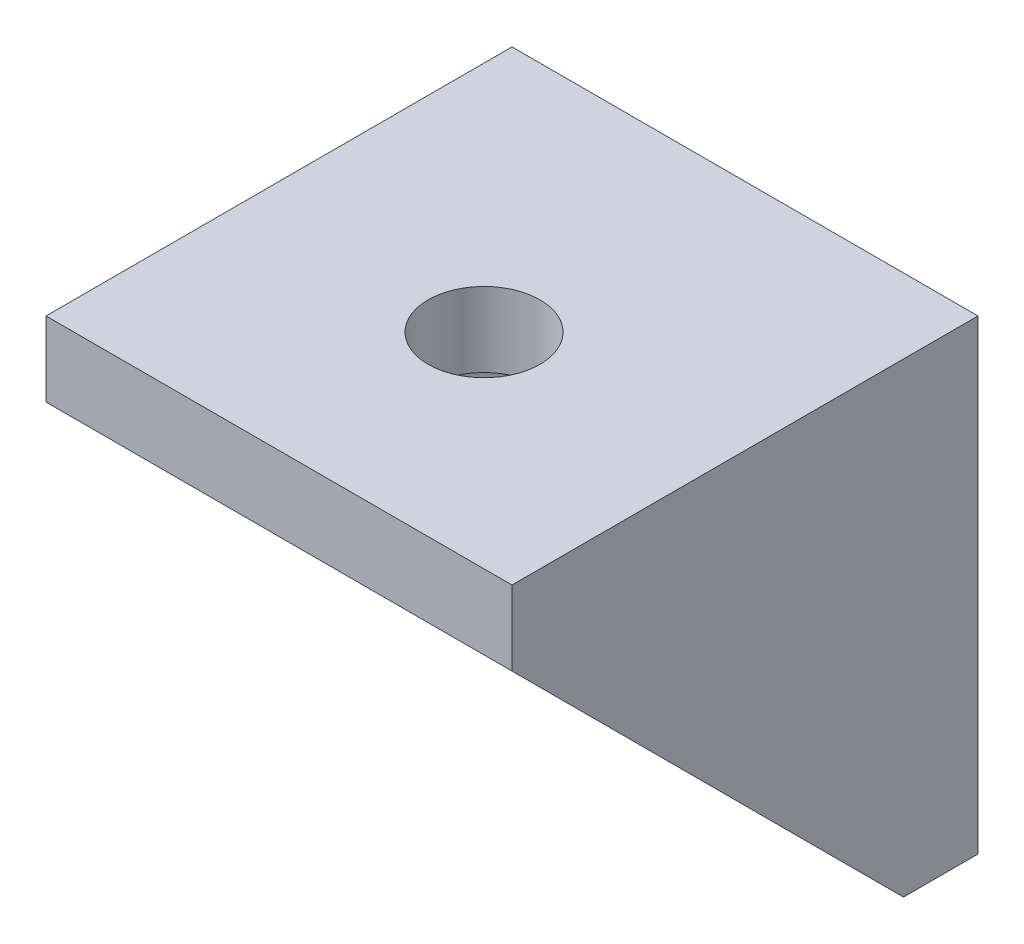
ISO-10303-21;
HEADER;
FILE_DESCRIPTION(('STEP AP214'),'2;1');
FILE_NAME('part.step','',(''),(''),'','','');
FILE_SCHEMA(('AUTOMOTIVE_DESIGN { 1 0 10303 214 1 1 1 1 }'));
ENDSEC;
DATA;
#1=APPLICATION_CONTEXT('core data for automotive mechanical design processes');
#2=APPLICATION_PROTOCOL_DEFINITION('international standard','automotive_design',2000,#1);
#3=PRODUCT_CONTEXT('',#1,'mechanical');
#4=PRODUCT('Part','Part','',(#3));
#5=PRODUCT_RELATED_PRODUCT_CATEGORY('part','',(#4));
#6=PRODUCT_DEFINITION_FORMATION('','',#4);
#7=PRODUCT_DEFINITION_CONTEXT('part definition',#1,'design');
#8=PRODUCT_DEFINITION('design','',#6,#7);
#9=PRODUCT_DEFINITION_SHAPE('','',#8);
#10=(LENGTH_UNIT() NAMED_UNIT(*) SI_UNIT(.MILLI.,.METRE.));
#11=(NAMED_UNIT(*) PLANE_ANGLE_UNIT() SI_UNIT($,.RADIAN.));
#12=(NAMED_UNIT(*) SI_UNIT($,.STERADIAN.) SOLID_ANGLE_UNIT());
#13=UNCERTAINTY_MEASURE_WITH_UNIT(LENGTH_MEASURE(1.E-05),#10,'distance_accuracy_value','');
#14=(GEOMETRIC_REPRESENTATION_CONTEXT(3) GLOBAL_UNCERTAINTY_ASSIGNED_CONTEXT((#13)) GLOBAL_UNIT_ASSIGNED_CONTEXT((#10,
#11,#12)) REPRESENTATION_CONTEXT('',''));
#15=CARTESIAN_POINT('',(0.,0.,0.));
#16=DIRECTION('',(0.,0.,1.));
#17=DIRECTION('',(1.,0.,0.));
#18=AXIS2_PLACEMENT_3D('',#15,#16,#17);
#19=CARTESIAN_POINT('',(0.,0.,4.));
#20=DIRECTION('',(0.,0.,-1.));
#21=DIRECTION('',(-1.,0.,0.));
#22=AXIS2_PLACEMENT_3D('',#19,#20,#21);
#23=PLANE('',#22);
#24=CARTESIAN_POINT('',(0.,0.,4.));
#25=DIRECTION('',(0.,0.,1.));
#26=DIRECTION('',(1.,0.,0.));
#27=AXIS2_PLACEMENT_3D('',#24,#25,#26);
#28=CIRCLE('',#27,3.);
#29=CARTESIAN_POINT('',(3.,0.,4.));
#30=VERTEX_POINT('',#29);
#31=EDGE_CURVE('E133',#30,#30,#28,.T.);
#32=ORIENTED_EDGE('',*,*,#31,.F.);
#33=EDGE_LOOP('',(#32));
#34=FACE_BOUND('',#33,.T.);
#35=DIRECTION('',(0.,1.,0.));
#36=VECTOR('',#35,1.);
#37=CARTESIAN_POINT('',(-8.5,-12.5,4.));
#38=LINE('',#37,#36);
#39=CARTESIAN_POINT('',(-8.5,-12.5,4.));
#40=VERTEX_POINT('',#39);
#41=CARTESIAN_POINT('',(-8.5,8.5,4.));
#42=VERTEX_POINT('',#41);
#43=EDGE_CURVE('E100',#40,#42,#38,.T.);
#44=ORIENTED_EDGE('',*,*,#43,.F.);
#45=DIRECTION('',(1.,0.,0.));
#46=VECTOR('',#45,1.);
#47=CARTESIAN_POINT('',(-12.5,-12.5,4.));
#48=LINE('',#47,#46);
#49=CARTESIAN_POINT('',(8.5,-12.5,4.));
#50=VERTEX_POINT('',#49);
#51=EDGE_CURVE('E112',#40,#50,#48,.T.);
#52=ORIENTED_EDGE('',*,*,#51,.T.);
#53=DIRECTION('',(0.,1.,0.));
#54=VECTOR('',#53,1.);
#55=CARTESIAN_POINT('',(8.5,-12.5,4.));
#56=LINE('',#55,#54);
#57=CARTESIAN_POINT('',(8.5,8.5,4.));
#58=VERTEX_POINT('',#57);
#59=EDGE_CURVE('E168',#50,#58,#56,.T.);
#60=ORIENTED_EDGE('',*,*,#59,.T.);
#61=DIRECTION('',(1.,0.,0.));
#62=VECTOR('',#61,1.);
#63=CARTESIAN_POINT('',(0.,8.5,4.));
#64=LINE('',#63,#62);
#65=EDGE_CURVE('E118',#42,#58,#64,.T.);
#66=ORIENTED_EDGE('',*,*,#65,.F.);
#67=EDGE_LOOP('',(#44,#52,#60,#66));
#68=FACE_BOUND('',#67,.T.);
#69=ADVANCED_FACE('F32',(#34,#68),#23,.F.);
#70=CARTESIAN_POINT('',(0.,8.5,0.));
#71=DIRECTION('',(0.,1.,0.));
#72=DIRECTION('',(0.,0.,1.));
#73=AXIS2_PLACEMENT_3D('',#70,#71,#72);
#74=PLANE('',#73);
#75=CARTESIAN_POINT('',(0.,8.5,14.));
#76=DIRECTION('',(0.,1.,0.));
#77=DIRECTION('',(0.,0.,1.));
#78=AXIS2_PLACEMENT_3D('',#75,#76,#77);
#79=CIRCLE('',#78,3.);
#80=CARTESIAN_POINT('',(0.,8.5,17.));
#81=VERTEX_POINT('',#80);
#82=EDGE_CURVE('E174',#81,#81,#79,.T.);
#83=ORIENTED_EDGE('',*,*,#82,.T.);
#84=EDGE_LOOP('',(#83));
#85=FACE_BOUND('',#84,.T.);
#86=DIRECTION('',(0.,0.,1.));
#87=VECTOR('',#86,1.);
#88=CARTESIAN_POINT('',(-8.5,8.5,4.));
#89=LINE('',#88,#87);
#90=CARTESIAN_POINT('',(-8.5,8.5,25.));
#91=VERTEX_POINT('',#90);
#92=EDGE_CURVE('E47',#42,#91,#89,.T.);
#93=ORIENTED_EDGE('',*,*,#92,.F.);
#94=ORIENTED_EDGE('',*,*,#65,.T.);
#95=DIRECTION('',(0.,0.,1.));
#96=VECTOR('',#95,1.);
#97=CARTESIAN_POINT('',(8.5,8.5,4.));
#98=LINE('',#97,#96);
#99=CARTESIAN_POINT('',(8.5,8.5,25.));
#100=VERTEX_POINT('',#99);
#101=EDGE_CURVE('E161',#58,#100,#98,.T.);
#102=ORIENTED_EDGE('',*,*,#101,.T.);
#103=DIRECTION('',(1.,0.,0.));
#104=VECTOR('',#103,1.);
#105=CARTESIAN_POINT('',(-12.5,8.5,25.));
#106=LINE('',#105,#104);
#107=EDGE_CURVE('E183',#91,#100,#106,.T.);
#108=ORIENTED_EDGE('',*,*,#107,.F.);
#109=EDGE_LOOP('',(#93,#94,#102,#108));
#110=FACE_BOUND('',#109,.T.);
#111=ADVANCED_FACE('F207',(#85,#110),#74,.F.);
#112=CARTESIAN_POINT('',(0.,0.,0.));
#113=DIRECTION('',(0.,0.,-1.));
#114=DIRECTION('',(-1.,0.,0.));
#115=AXIS2_PLACEMENT_3D('',#112,#113,#114);
#116=PLANE('',#115);
#117=DIRECTION('',(-1.,0.,0.));
#118=VECTOR('',#117,1.);
#119=CARTESIAN_POINT('',(-12.5,12.5,0.));
#120=LINE('',#119,#118);
#121=CARTESIAN_POINT('',(12.5,12.5,0.));
#122=VERTEX_POINT('',#121);
#123=CARTESIAN_POINT('',(-12.5,12.5,0.));
#124=VERTEX_POINT('',#123);
#125=EDGE_CURVE('E132',#122,#124,#120,.T.);
#126=ORIENTED_EDGE('',*,*,#125,.F.);
#127=DIRECTION('',(0.,1.,0.));
#128=VECTOR('',#127,1.);
#129=CARTESIAN_POINT('',(12.5,-12.5,0.));
#130=LINE('',#129,#128);
#131=CARTESIAN_POINT('',(12.5,-12.5,0.));
#132=VERTEX_POINT('',#131);
#133=EDGE_CURVE('E130',#132,#122,#130,.T.);
#134=ORIENTED_EDGE('',*,*,#133,.F.);
#135=DIRECTION('',(1.,0.,0.));
#136=VECTOR('',#135,1.);
#137=CARTESIAN_POINT('',(-12.5,-12.5,0.));
#138=LINE('',#137,#136);
#139=CARTESIAN_POINT('',(-12.5,-12.5,0.));
#140=VERTEX_POINT('',#139);
#141=EDGE_CURVE('E55',#140,#132,#138,.T.);
#142=ORIENTED_EDGE('',*,*,#141,.F.);
#143=DIRECTION('',(0.,-1.,0.));
#144=VECTOR('',#143,1.);
#145=CARTESIAN_POINT('',(-12.5,-12.5,0.));
#146=LINE('',#145,#144);
#147=EDGE_CURVE('E124',#124,#140,#146,.T.);
#148=ORIENTED_EDGE('',*,*,#147,.F.);
#149=EDGE_LOOP('',(#126,#134,#142,#148));
#150=FACE_BOUND('',#149,.T.);
#151=CARTESIAN_POINT('',(0.,0.,0.));
#152=DIRECTION('',(0.,0.,1.));
#153=DIRECTION('',(1.,0.,0.));
#154=AXIS2_PLACEMENT_3D('',#151,#152,#153);
#155=CIRCLE('',#154,3.);
#156=CARTESIAN_POINT('',(3.,0.,0.));
#157=VERTEX_POINT('',#156);
#158=EDGE_CURVE('E128',#157,#157,#155,.T.);
#159=ORIENTED_EDGE('',*,*,#158,.T.);
#160=EDGE_LOOP('',(#159));
#161=FACE_BOUND('',#160,.T.);
#162=ADVANCED_FACE('F150',(#150,#161),#116,.T.);
#163=CARTESIAN_POINT('',(12.5,-12.5,4.));
#164=DIRECTION('',(-1.,0.,0.));
#165=DIRECTION('',(0.,0.,1.));
#166=AXIS2_PLACEMENT_3D('',#163,#164,#165);
#167=PLANE('',#166);
#168=DIRECTION('',(0.,0.,-1.));
#169=VECTOR('',#168,1.);
#170=CARTESIAN_POINT('',(12.5,12.5,4.));
#171=LINE('',#170,#169);
#172=CARTESIAN_POINT('',(12.5,12.5,25.));
#173=VERTEX_POINT('',#172);
#174=EDGE_CURVE('E11',#173,#122,#171,.T.);
#175=ORIENTED_EDGE('',*,*,#174,.F.);
#176=DIRECTION('',(0.,1.,0.));
#177=VECTOR('',#176,1.);
#178=CARTESIAN_POINT('',(12.5,8.5,25.));
#179=LINE('',#178,#177);
#180=CARTESIAN_POINT('',(12.5,8.5,25.));
#181=VERTEX_POINT('',#180);
#182=EDGE_CURVE('E157',#181,#173,#179,.T.);
#183=ORIENTED_EDGE('',*,*,#182,.F.);
#184=DIRECTION('',(0.,-0.707106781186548,-0.707106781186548));
#185=VECTOR('',#184,1.);
#186=CARTESIAN_POINT('',(12.5,8.5,25.));
#187=LINE('',#186,#185);
#188=CARTESIAN_POINT('',(12.5,-12.5,4.));
#189=VERTEX_POINT('',#188);
#190=EDGE_CURVE('E119',#181,#189,#187,.T.);
#191=ORIENTED_EDGE('',*,*,#190,.T.);
#192=DIRECTION('',(0.,0.,-1.));
#193=VECTOR('',#192,1.);
#194=CARTESIAN_POINT('',(12.5,-12.5,4.));
#195=LINE('',#194,#193);
#196=EDGE_CURVE('E111',#189,#132,#195,.T.);
#197=ORIENTED_EDGE('',*,*,#196,.T.);
#198=ORIENTED_EDGE('',*,*,#133,.T.);
#199=EDGE_LOOP('',(#175,#183,#191,#197,#198));
#200=FACE_BOUND('',#199,.T.);
#201=ADVANCED_FACE('F34',(#200),#167,.F.);
#202=CARTESIAN_POINT('',(-12.5,12.5,4.));
#203=DIRECTION('',(0.,-1.,0.));
#204=DIRECTION('',(0.,0.,-1.));
#205=AXIS2_PLACEMENT_3D('',#202,#203,#204);
#206=PLANE('',#205);
#207=ORIENTED_EDGE('',*,*,#125,.T.);
#208=DIRECTION('',(0.,0.,-1.));
#209=VECTOR('',#208,1.);
#210=CARTESIAN_POINT('',(-12.5,12.5,4.));
#211=LINE('',#210,#209);
#212=CARTESIAN_POINT('',(-12.5,12.5,25.));
#213=VERTEX_POINT('',#212);
#214=EDGE_CURVE('E40',#213,#124,#211,.T.);
#215=ORIENTED_EDGE('',*,*,#214,.F.);
#216=DIRECTION('',(1.,0.,0.));
#217=VECTOR('',#216,1.);
#218=CARTESIAN_POINT('',(-12.5,12.5,25.));
#219=LINE('',#218,#217);
#220=EDGE_CURVE('E177',#213,#173,#219,.T.);
#221=ORIENTED_EDGE('',*,*,#220,.T.);
#222=ORIENTED_EDGE('',*,*,#174,.T.);
#223=EDGE_LOOP('',(#207,#215,#221,#222));
#224=FACE_BOUND('',#223,.T.);
#225=CARTESIAN_POINT('',(0.,12.5,14.));
#226=DIRECTION('',(0.,1.,0.));
#227=DIRECTION('',(0.,0.,1.));
#228=AXIS2_PLACEMENT_3D('',#225,#226,#227);
#229=CIRCLE('',#228,3.);
#230=CARTESIAN_POINT('',(0.,12.5,17.));
#231=VERTEX_POINT('',#230);
#232=EDGE_CURVE('E171',#231,#231,#229,.T.);
#233=ORIENTED_EDGE('',*,*,#232,.F.);
#234=EDGE_LOOP('',(#233));
#235=FACE_BOUND('',#234,.T.);
#236=ADVANCED_FACE('F218',(#224,#235),#206,.F.);
#237=CARTESIAN_POINT('',(-12.5,-12.5,4.));
#238=DIRECTION('',(1.,0.,0.));
#239=DIRECTION('',(0.,0.,-1.));
#240=AXIS2_PLACEMENT_3D('',#237,#238,#239);
#241=PLANE('',#240);
#242=DIRECTION('',(0.,0.,-1.));
#243=VECTOR('',#242,1.);
#244=CARTESIAN_POINT('',(-12.5,-12.5,4.));
#245=LINE('',#244,#243);
#246=CARTESIAN_POINT('',(-12.5,-12.5,4.));
#247=VERTEX_POINT('',#246);
#248=EDGE_CURVE('E137',#247,#140,#245,.T.);
#249=ORIENTED_EDGE('',*,*,#248,.F.);
#250=DIRECTION('',(0.,-0.707106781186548,-0.707106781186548));
#251=VECTOR('',#250,1.);
#252=CARTESIAN_POINT('',(-12.5,8.5,25.));
#253=LINE('',#252,#251);
#254=CARTESIAN_POINT('',(-12.5,8.5,25.));
#255=VERTEX_POINT('',#254);
#256=EDGE_CURVE('E108',#255,#247,#253,.T.);
#257=ORIENTED_EDGE('',*,*,#256,.F.);
#258=DIRECTION('',(0.,1.,0.));
#259=VECTOR('',#258,1.);
#260=CARTESIAN_POINT('',(-12.5,8.5,25.));
#261=LINE('',#260,#259);
#262=EDGE_CURVE('E144',#255,#213,#261,.T.);
#263=ORIENTED_EDGE('',*,*,#262,.T.);
#264=ORIENTED_EDGE('',*,*,#214,.T.);
#265=ORIENTED_EDGE('',*,*,#147,.T.);
#266=EDGE_LOOP('',(#249,#257,#263,#264,#265));
#267=FACE_BOUND('',#266,.T.);
#268=ADVANCED_FACE('F142',(#267),#241,.F.);
#269=CARTESIAN_POINT('',(-12.5,-12.5,4.));
#270=DIRECTION('',(0.,1.,0.));
#271=DIRECTION('',(0.,0.,1.));
#272=AXIS2_PLACEMENT_3D('',#269,#270,#271);
#273=PLANE('',#272);
#274=ORIENTED_EDGE('',*,*,#141,.T.);
#275=ORIENTED_EDGE('',*,*,#196,.F.);
#276=DIRECTION('',(1.,0.,0.));
#277=VECTOR('',#276,1.);
#278=CARTESIAN_POINT('',(8.5,-12.5,4.));
#279=LINE('',#278,#277);
#280=EDGE_CURVE('E123',#50,#189,#279,.T.);
#281=ORIENTED_EDGE('',*,*,#280,.F.);
#282=ORIENTED_EDGE('',*,*,#51,.F.);
#283=EDGE_CURVE('E106',#247,#40,#48,.T.);
#284=ORIENTED_EDGE('',*,*,#283,.F.);
#285=ORIENTED_EDGE('',*,*,#248,.T.);
#286=EDGE_LOOP('',(#274,#275,#281,#282,#284,#285));
#287=FACE_BOUND('',#286,.T.);
#288=ADVANCED_FACE('F122',(#287),#273,.F.);
#289=CARTESIAN_POINT('',(0.,0.,4.));
#290=DIRECTION('',(0.,0.,-1.));
#291=DIRECTION('',(-1.,0.,0.));
#292=AXIS2_PLACEMENT_3D('',#289,#290,#291);
#293=CYLINDRICAL_SURFACE('',#292,3.);
#294=ORIENTED_EDGE('',*,*,#31,.T.);
#295=EDGE_LOOP('',(#294));
#296=FACE_BOUND('',#295,.T.);
#297=ORIENTED_EDGE('',*,*,#158,.F.);
#298=EDGE_LOOP('',(#297));
#299=FACE_BOUND('',#298,.T.);
#300=ADVANCED_FACE('F193',(#296,#299),#293,.F.);
#301=CARTESIAN_POINT('',(-12.5,8.5,25.));
#302=DIRECTION('',(0.,0.,1.));
#303=DIRECTION('',(1.,0.,0.));
#304=AXIS2_PLACEMENT_3D('',#301,#302,#303);
#305=PLANE('',#304);
#306=ORIENTED_EDGE('',*,*,#220,.F.);
#307=ORIENTED_EDGE('',*,*,#262,.F.);
#308=EDGE_CURVE('E180',#255,#91,#106,.T.);
#309=ORIENTED_EDGE('',*,*,#308,.T.);
#310=ORIENTED_EDGE('',*,*,#107,.T.);
#311=DIRECTION('',(1.,0.,0.));
#312=VECTOR('',#311,1.);
#313=CARTESIAN_POINT('',(8.5,8.5,25.));
#314=LINE('',#313,#312);
#315=EDGE_CURVE('E172',#100,#181,#314,.T.);
#316=ORIENTED_EDGE('',*,*,#315,.T.);
#317=ORIENTED_EDGE('',*,*,#182,.T.);
#318=EDGE_LOOP('',(#306,#307,#309,#310,#316,#317));
#319=FACE_BOUND('',#318,.T.);
#320=ADVANCED_FACE('F195',(#319),#305,.T.);
#321=CARTESIAN_POINT('',(0.,8.5,14.));
#322=DIRECTION('',(0.,1.,0.));
#323=DIRECTION('',(0.,0.,1.));
#324=AXIS2_PLACEMENT_3D('',#321,#322,#323);
#325=CYLINDRICAL_SURFACE('',#324,3.);
#326=ORIENTED_EDGE('',*,*,#82,.F.);
#327=EDGE_LOOP('',(#326));
#328=FACE_BOUND('',#327,.T.);
#329=ORIENTED_EDGE('',*,*,#232,.T.);
#330=EDGE_LOOP('',(#329));
#331=FACE_BOUND('',#330,.T.);
#332=ADVANCED_FACE('F201',(#328,#331),#325,.F.);
#333=CARTESIAN_POINT('',(8.5,8.5,25.));
#334=DIRECTION('',(0.,-0.707106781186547,0.707106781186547));
#335=DIRECTION('',(0.,-0.707106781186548,-0.707106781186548));
#336=AXIS2_PLACEMENT_3D('',#333,#334,#335);
#337=PLANE('',#336);
#338=ORIENTED_EDGE('',*,*,#190,.F.);
#339=ORIENTED_EDGE('',*,*,#315,.F.);
#340=DIRECTION('',(0.,-0.707106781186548,-0.707106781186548));
#341=VECTOR('',#340,1.);
#342=CARTESIAN_POINT('',(8.5,8.5,25.));
#343=LINE('',#342,#341);
#344=EDGE_CURVE('E164',#100,#50,#343,.T.);
#345=ORIENTED_EDGE('',*,*,#344,.T.);
#346=ORIENTED_EDGE('',*,*,#280,.T.);
#347=EDGE_LOOP('',(#338,#339,#345,#346));
#348=FACE_BOUND('',#347,.T.);
#349=ADVANCED_FACE('F227',(#348),#337,.T.);
#350=CARTESIAN_POINT('',(8.5,0.,0.));
#351=DIRECTION('',(-1.,0.,0.));
#352=DIRECTION('',(0.,0.,1.));
#353=AXIS2_PLACEMENT_3D('',#350,#351,#352);
#354=PLANE('',#353);
#355=ORIENTED_EDGE('',*,*,#101,.F.);
#356=ORIENTED_EDGE('',*,*,#59,.F.);
#357=ORIENTED_EDGE('',*,*,#344,.F.);
#358=EDGE_LOOP('',(#355,#356,#357));
#359=FACE_BOUND('',#358,.T.);
#360=ADVANCED_FACE('F233',(#359),#354,.T.);
#361=CARTESIAN_POINT('',(-8.5,8.5,25.));
#362=DIRECTION('',(0.,0.707106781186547,-0.707106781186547));
#363=DIRECTION('',(0.,0.707106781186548,0.707106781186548));
#364=AXIS2_PLACEMENT_3D('',#361,#362,#363);
#365=PLANE('',#364);
#366=ORIENTED_EDGE('',*,*,#256,.T.);
#367=ORIENTED_EDGE('',*,*,#283,.T.);
#368=DIRECTION('',(0.,-0.707106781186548,-0.707106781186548));
#369=VECTOR('',#368,1.);
#370=CARTESIAN_POINT('',(-8.5,8.5,25.));
#371=LINE('',#370,#369);
#372=EDGE_CURVE('E96',#91,#40,#371,.T.);
#373=ORIENTED_EDGE('',*,*,#372,.F.);
#374=ORIENTED_EDGE('',*,*,#308,.F.);
#375=EDGE_LOOP('',(#366,#367,#373,#374));
#376=FACE_BOUND('',#375,.T.);
#377=ADVANCED_FACE('F107',(#376),#365,.F.);
#378=CARTESIAN_POINT('',(-8.5,0.,0.));
#379=DIRECTION('',(-1.,0.,0.));
#380=DIRECTION('',(0.,0.,1.));
#381=AXIS2_PLACEMENT_3D('',#378,#379,#380);
#382=PLANE('',#381);
#383=ORIENTED_EDGE('',*,*,#92,.T.);
#384=ORIENTED_EDGE('',*,*,#372,.T.);
#385=ORIENTED_EDGE('',*,*,#43,.T.);
#386=EDGE_LOOP('',(#383,#384,#385));
#387=FACE_BOUND('',#386,.T.);
#388=ADVANCED_FACE('F98',(#387),#382,.F.);
#389=CLOSED_SHELL('',(#69,#111,#162,#201,#236,#268,#288,#300,#320,#332,#349,#360,#377,#388));
#390=MANIFOLD_SOLID_BREP('B2',#389);
#391=ADVANCED_BREP_SHAPE_REPRESENTATION('',(#18,#390),#14);
#392=SHAPE_DEFINITION_REPRESENTATION(#9,#391);
ENDSEC;
END-ISO-10303-21;
